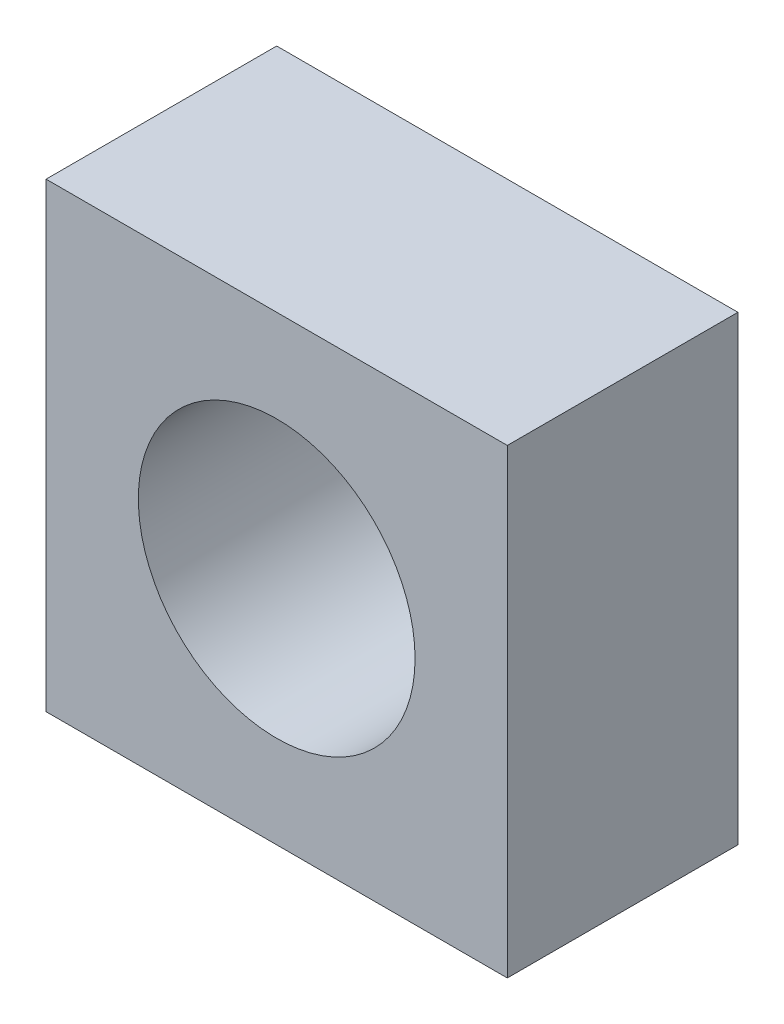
ISO-10303-21;
HEADER;
FILE_DESCRIPTION(('STEP AP214'),'2;1');
FILE_NAME('part.step','',(''),(''),'','','');
FILE_SCHEMA(('AUTOMOTIVE_DESIGN { 1 0 10303 214 1 1 1 1 }'));
ENDSEC;
DATA;
#1=APPLICATION_CONTEXT('core data for automotive mechanical design processes');
#2=APPLICATION_PROTOCOL_DEFINITION('international standard','automotive_design',2000,#1);
#3=PRODUCT_CONTEXT('',#1,'mechanical');
#4=PRODUCT('Part','Part','',(#3));
#5=PRODUCT_RELATED_PRODUCT_CATEGORY('part','',(#4));
#6=PRODUCT_DEFINITION_FORMATION('','',#4);
#7=PRODUCT_DEFINITION_CONTEXT('part definition',#1,'design');
#8=PRODUCT_DEFINITION('design','',#6,#7);
#9=PRODUCT_DEFINITION_SHAPE('','',#8);
#10=(LENGTH_UNIT() NAMED_UNIT(*) SI_UNIT(.MILLI.,.METRE.));
#11=(NAMED_UNIT(*) PLANE_ANGLE_UNIT() SI_UNIT($,.RADIAN.));
#12=(NAMED_UNIT(*) SI_UNIT($,.STERADIAN.) SOLID_ANGLE_UNIT());
#13=UNCERTAINTY_MEASURE_WITH_UNIT(LENGTH_MEASURE(1.E-05),#10,'distance_accuracy_value','');
#14=(GEOMETRIC_REPRESENTATION_CONTEXT(3) GLOBAL_UNCERTAINTY_ASSIGNED_CONTEXT((#13)) GLOBAL_UNIT_ASSIGNED_CONTEXT((#10,
#11,#12)) REPRESENTATION_CONTEXT('',''));
#15=CARTESIAN_POINT('',(0.,0.,0.));
#16=DIRECTION('',(0.,0.,1.));
#17=DIRECTION('',(1.,0.,0.));
#18=AXIS2_PLACEMENT_3D('',#15,#16,#17);
#19=CARTESIAN_POINT('',(5.,5.,0.));
#20=DIRECTION('',(1.,0.,0.));
#21=DIRECTION('',(0.,0.,-1.));
#22=AXIS2_PLACEMENT_3D('',#19,#20,#21);
#23=PLANE('',#22);
#24=DIRECTION('',(0.,1.,0.));
#25=VECTOR('',#24,1.);
#26=CARTESIAN_POINT('',(5.,0.,0.));
#27=LINE('',#26,#25);
#28=CARTESIAN_POINT('',(5.,-5.,0.));
#29=VERTEX_POINT('',#28);
#30=CARTESIAN_POINT('',(5.,5.,0.));
#31=VERTEX_POINT('',#30);
#32=EDGE_CURVE('E89',#29,#31,#27,.T.);
#33=ORIENTED_EDGE('',*,*,#32,.T.);
#34=DIRECTION('',(0.,0.,1.));
#35=VECTOR('',#34,1.);
#36=CARTESIAN_POINT('',(5.,5.,0.));
#37=LINE('',#36,#35);
#38=CARTESIAN_POINT('',(5.,5.,5.));
#39=VERTEX_POINT('',#38);
#40=EDGE_CURVE('E80',#39,#31,#37,.F.);
#41=ORIENTED_EDGE('',*,*,#40,.F.);
#42=DIRECTION('',(0.,1.,0.));
#43=VECTOR('',#42,1.);
#44=CARTESIAN_POINT('',(5.,0.,5.));
#45=LINE('',#44,#43);
#46=CARTESIAN_POINT('',(5.,-5.,5.));
#47=VERTEX_POINT('',#46);
#48=EDGE_CURVE('E73',#47,#39,#45,.T.);
#49=ORIENTED_EDGE('',*,*,#48,.F.);
#50=DIRECTION('',(0.,0.,-1.));
#51=VECTOR('',#50,1.);
#52=CARTESIAN_POINT('',(5.,-5.,0.));
#53=LINE('',#52,#51);
#54=EDGE_CURVE('E64',#29,#47,#53,.F.);
#55=ORIENTED_EDGE('',*,*,#54,.F.);
#56=EDGE_LOOP('',(#33,#41,#49,#55));
#57=FACE_BOUND('',#56,.T.);
#58=ADVANCED_FACE('F15',(#57),#23,.T.);
#59=CARTESIAN_POINT('',(-5.,5.,0.));
#60=DIRECTION('',(0.,1.,0.));
#61=DIRECTION('',(0.,0.,1.));
#62=AXIS2_PLACEMENT_3D('',#59,#60,#61);
#63=PLANE('',#62);
#64=DIRECTION('',(1.,0.,0.));
#65=VECTOR('',#64,1.);
#66=CARTESIAN_POINT('',(0.,5.,0.));
#67=LINE('',#66,#65);
#68=CARTESIAN_POINT('',(-5.,5.,0.));
#69=VERTEX_POINT('',#68);
#70=EDGE_CURVE('E84',#31,#69,#67,.F.);
#71=ORIENTED_EDGE('',*,*,#70,.T.);
#72=DIRECTION('',(0.,0.,1.));
#73=VECTOR('',#72,1.);
#74=CARTESIAN_POINT('',(-5.,5.,0.));
#75=LINE('',#74,#73);
#76=CARTESIAN_POINT('',(-5.,5.,5.));
#77=VERTEX_POINT('',#76);
#78=EDGE_CURVE('E52',#77,#69,#75,.F.);
#79=ORIENTED_EDGE('',*,*,#78,.F.);
#80=DIRECTION('',(1.,0.,0.));
#81=VECTOR('',#80,1.);
#82=CARTESIAN_POINT('',(0.,5.,5.));
#83=LINE('',#82,#81);
#84=EDGE_CURVE('E62',#39,#77,#83,.F.);
#85=ORIENTED_EDGE('',*,*,#84,.F.);
#86=ORIENTED_EDGE('',*,*,#40,.T.);
#87=EDGE_LOOP('',(#71,#79,#85,#86));
#88=FACE_BOUND('',#87,.T.);
#89=ADVANCED_FACE('F83',(#88),#63,.T.);
#90=CARTESIAN_POINT('',(-5.,-5.,0.));
#91=DIRECTION('',(-1.,0.,0.));
#92=DIRECTION('',(0.,0.,1.));
#93=AXIS2_PLACEMENT_3D('',#90,#91,#92);
#94=PLANE('',#93);
#95=DIRECTION('',(0.,1.,0.));
#96=VECTOR('',#95,1.);
#97=CARTESIAN_POINT('',(-5.,0.,0.));
#98=LINE('',#97,#96);
#99=CARTESIAN_POINT('',(-5.,-5.,0.));
#100=VERTEX_POINT('',#99);
#101=EDGE_CURVE('E69',#69,#100,#98,.F.);
#102=ORIENTED_EDGE('',*,*,#101,.T.);
#103=DIRECTION('',(0.,0.,-1.));
#104=VECTOR('',#103,1.);
#105=CARTESIAN_POINT('',(-5.,-5.,0.));
#106=LINE('',#105,#104);
#107=CARTESIAN_POINT('',(-5.,-5.,5.));
#108=VERTEX_POINT('',#107);
#109=EDGE_CURVE('E31',#108,#100,#106,.T.);
#110=ORIENTED_EDGE('',*,*,#109,.F.);
#111=DIRECTION('',(0.,1.,0.));
#112=VECTOR('',#111,1.);
#113=CARTESIAN_POINT('',(-5.,0.,5.));
#114=LINE('',#113,#112);
#115=EDGE_CURVE('E58',#77,#108,#114,.F.);
#116=ORIENTED_EDGE('',*,*,#115,.F.);
#117=ORIENTED_EDGE('',*,*,#78,.T.);
#118=EDGE_LOOP('',(#102,#110,#116,#117));
#119=FACE_BOUND('',#118,.T.);
#120=ADVANCED_FACE('F67',(#119),#94,.T.);
#121=CARTESIAN_POINT('',(5.,-5.,0.));
#122=DIRECTION('',(0.,-1.,0.));
#123=DIRECTION('',(0.,0.,-1.));
#124=AXIS2_PLACEMENT_3D('',#121,#122,#123);
#125=PLANE('',#124);
#126=DIRECTION('',(1.,0.,0.));
#127=VECTOR('',#126,1.);
#128=CARTESIAN_POINT('',(0.,-5.,0.));
#129=LINE('',#128,#127);
#130=EDGE_CURVE('E94',#100,#29,#129,.T.);
#131=ORIENTED_EDGE('',*,*,#130,.T.);
#132=ORIENTED_EDGE('',*,*,#54,.T.);
#133=DIRECTION('',(1.,0.,0.));
#134=VECTOR('',#133,1.);
#135=CARTESIAN_POINT('',(0.,-5.,5.));
#136=LINE('',#135,#134);
#137=EDGE_CURVE('E60',#108,#47,#136,.T.);
#138=ORIENTED_EDGE('',*,*,#137,.F.);
#139=ORIENTED_EDGE('',*,*,#109,.T.);
#140=EDGE_LOOP('',(#131,#132,#138,#139));
#141=FACE_BOUND('',#140,.T.);
#142=ADVANCED_FACE('F71',(#141),#125,.T.);
#143=CARTESIAN_POINT('',(0.,0.,5.));
#144=DIRECTION('',(0.,0.,1.));
#145=DIRECTION('',(1.,0.,0.));
#146=AXIS2_PLACEMENT_3D('',#143,#144,#145);
#147=PLANE('',#146);
#148=CARTESIAN_POINT('',(0.,0.,5.));
#149=DIRECTION('',(0.,0.,1.));
#150=DIRECTION('',(1.,0.,0.));
#151=AXIS2_PLACEMENT_3D('',#148,#149,#150);
#152=CIRCLE('',#151,3.);
#153=CARTESIAN_POINT('',(3.,0.,5.));
#154=VERTEX_POINT('',#153);
#155=EDGE_CURVE('E18',#154,#154,#152,.F.);
#156=ORIENTED_EDGE('',*,*,#155,.T.);
#157=EDGE_LOOP('',(#156));
#158=FACE_BOUND('',#157,.T.);
#159=ORIENTED_EDGE('',*,*,#48,.T.);
#160=ORIENTED_EDGE('',*,*,#84,.T.);
#161=ORIENTED_EDGE('',*,*,#115,.T.);
#162=ORIENTED_EDGE('',*,*,#137,.T.);
#163=EDGE_LOOP('',(#159,#160,#161,#162));
#164=FACE_BOUND('',#163,.T.);
#165=ADVANCED_FACE('F59',(#158,#164),#147,.T.);
#166=CARTESIAN_POINT('',(0.,0.,0.));
#167=DIRECTION('',(0.,0.,1.));
#168=DIRECTION('',(1.,0.,0.));
#169=AXIS2_PLACEMENT_3D('',#166,#167,#168);
#170=PLANE('',#169);
#171=CARTESIAN_POINT('',(0.,0.,0.));
#172=DIRECTION('',(0.,0.,1.));
#173=DIRECTION('',(1.,0.,0.));
#174=AXIS2_PLACEMENT_3D('',#171,#172,#173);
#175=CIRCLE('',#174,3.);
#176=CARTESIAN_POINT('',(3.,0.,0.));
#177=VERTEX_POINT('',#176);
#178=EDGE_CURVE('E10',#177,#177,#175,.T.);
#179=ORIENTED_EDGE('',*,*,#178,.T.);
#180=EDGE_LOOP('',(#179));
#181=FACE_BOUND('',#180,.T.);
#182=ORIENTED_EDGE('',*,*,#101,.F.);
#183=ORIENTED_EDGE('',*,*,#70,.F.);
#184=ORIENTED_EDGE('',*,*,#32,.F.);
#185=ORIENTED_EDGE('',*,*,#130,.F.);
#186=EDGE_LOOP('',(#182,#183,#184,#185));
#187=FACE_BOUND('',#186,.T.);
#188=ADVANCED_FACE('F88',(#181,#187),#170,.F.);
#189=CARTESIAN_POINT('',(0.,0.,0.));
#190=DIRECTION('',(0.,0.,1.));
#191=DIRECTION('',(1.,0.,0.));
#192=AXIS2_PLACEMENT_3D('',#189,#190,#191);
#193=CYLINDRICAL_SURFACE('',#192,3.);
#194=ORIENTED_EDGE('',*,*,#178,.F.);
#195=EDGE_LOOP('',(#194));
#196=FACE_BOUND('',#195,.T.);
#197=ORIENTED_EDGE('',*,*,#155,.F.);
#198=EDGE_LOOP('',(#197));
#199=FACE_BOUND('',#198,.T.);
#200=ADVANCED_FACE('F99',(#196,#199),#193,.F.);
#201=CLOSED_SHELL('',(#58,#89,#120,#142,#165,#188,#200));
#202=MANIFOLD_SOLID_BREP('B1',#201);
#203=ADVANCED_BREP_SHAPE_REPRESENTATION('',(#18,#202),#14);
#204=SHAPE_DEFINITION_REPRESENTATION(#9,#203);
ENDSEC;
END-ISO-10303-21;
